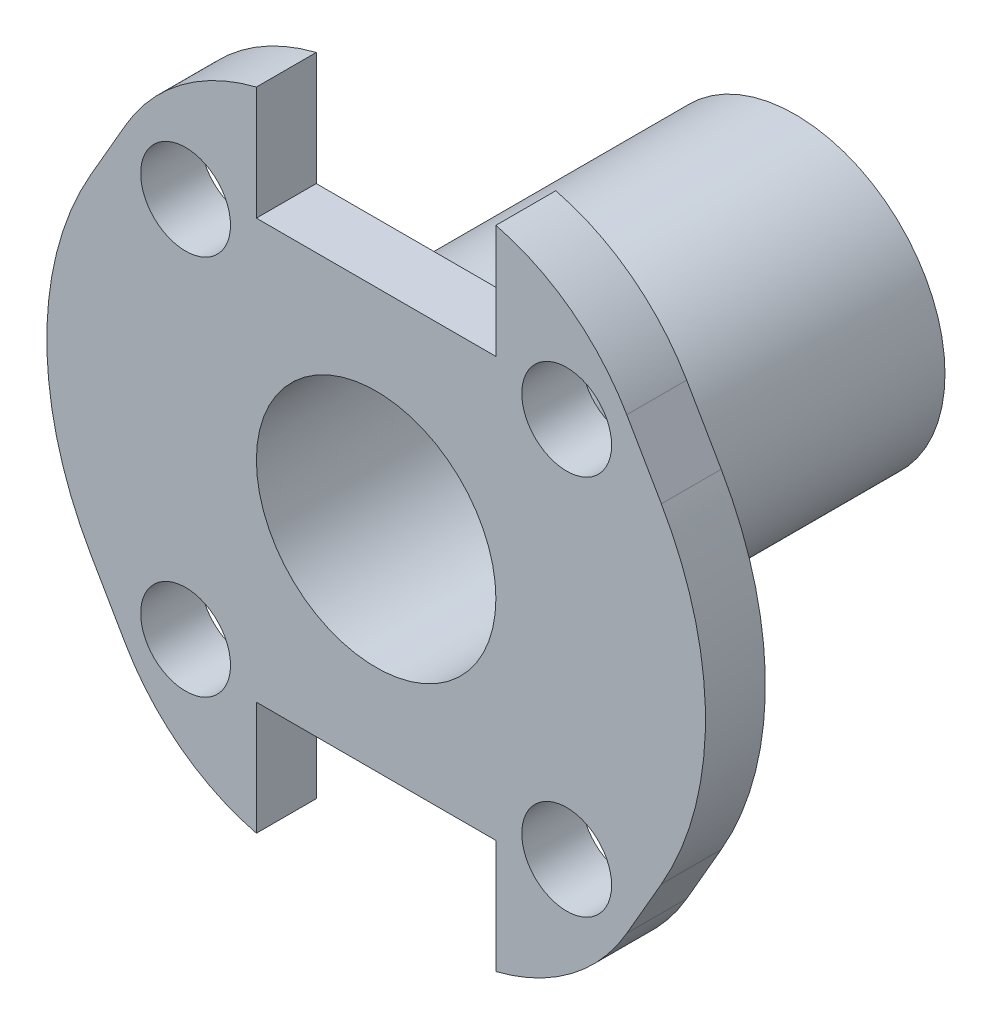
ISO-10303-21;
HEADER;
FILE_DESCRIPTION(('STEP AP214'),'2;1');
FILE_NAME('part.step','',(''),(''),'','','');
FILE_SCHEMA(('AUTOMOTIVE_DESIGN { 1 0 10303 214 1 1 1 1 }'));
ENDSEC;
DATA;
#1=APPLICATION_CONTEXT('core data for automotive mechanical design processes');
#2=APPLICATION_PROTOCOL_DEFINITION('international standard','automotive_design',2000,#1);
#3=PRODUCT_CONTEXT('',#1,'mechanical');
#4=PRODUCT('Part','Part','',(#3));
#5=PRODUCT_RELATED_PRODUCT_CATEGORY('part','',(#4));
#6=PRODUCT_DEFINITION_FORMATION('','',#4);
#7=PRODUCT_DEFINITION_CONTEXT('part definition',#1,'design');
#8=PRODUCT_DEFINITION('design','',#6,#7);
#9=PRODUCT_DEFINITION_SHAPE('','',#8);
#10=(LENGTH_UNIT() NAMED_UNIT(*) SI_UNIT(.MILLI.,.METRE.));
#11=(NAMED_UNIT(*) PLANE_ANGLE_UNIT() SI_UNIT($,.RADIAN.));
#12=(NAMED_UNIT(*) SI_UNIT($,.STERADIAN.) SOLID_ANGLE_UNIT());
#13=UNCERTAINTY_MEASURE_WITH_UNIT(LENGTH_MEASURE(1.E-05),#10,'distance_accuracy_value','');
#14=(GEOMETRIC_REPRESENTATION_CONTEXT(3) GLOBAL_UNCERTAINTY_ASSIGNED_CONTEXT((#13)) GLOBAL_UNIT_ASSIGNED_CONTEXT((#10,
#11,#12)) REPRESENTATION_CONTEXT('',''));
#15=CARTESIAN_POINT('',(0.,0.,0.));
#16=DIRECTION('',(0.,0.,1.));
#17=DIRECTION('',(1.,0.,0.));
#18=AXIS2_PLACEMENT_3D('',#15,#16,#17);
#19=CARTESIAN_POINT('',(-11.5470053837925,20.,10.));
#20=DIRECTION('',(0.,0.,1.));
#21=DIRECTION('',(1.,0.,0.));
#22=AXIS2_PLACEMENT_3D('',#19,#20,#21);
#23=PLANE('',#22);
#24=CARTESIAN_POINT('',(-31.819805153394,-31.8198051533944,10.));
#25=DIRECTION('',(0.,0.,1.));
#26=DIRECTION('',(1.,0.,0.));
#27=AXIS2_PLACEMENT_3D('',#24,#25,#26);
#28=CIRCLE('',#27,7.49999999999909);
#29=CARTESIAN_POINT('',(-24.3198051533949,-31.8198051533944,10.));
#30=VERTEX_POINT('',#29);
#31=EDGE_CURVE('E719',#30,#30,#28,.T.);
#32=ORIENTED_EDGE('',*,*,#31,.F.);
#33=EDGE_LOOP('',(#32));
#34=FACE_BOUND('',#33,.T.);
#35=CARTESIAN_POINT('',(31.8198051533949,31.8198051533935,10.));
#36=DIRECTION('',(0.,0.,1.));
#37=DIRECTION('',(1.,0.,0.));
#38=AXIS2_PLACEMENT_3D('',#35,#36,#37);
#39=CIRCLE('',#38,7.50000000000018);
#40=CARTESIAN_POINT('',(39.3198051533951,31.8198051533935,10.));
#41=VERTEX_POINT('',#40);
#42=EDGE_CURVE('E483',#41,#41,#39,.T.);
#43=ORIENTED_EDGE('',*,*,#42,.F.);
#44=EDGE_LOOP('',(#43));
#45=FACE_BOUND('',#44,.T.);
#46=DIRECTION('',(-1.,0.,0.));
#47=VECTOR('',#46,1.);
#48=CARTESIAN_POINT('',(20.,35.,10.));
#49=LINE('',#48,#47);
#50=CARTESIAN_POINT('',(20.,35.,10.));
#51=VERTEX_POINT('',#50);
#52=CARTESIAN_POINT('',(-20.,35.,10.));
#53=VERTEX_POINT('',#52);
#54=EDGE_CURVE('E517',#51,#53,#49,.T.);
#55=ORIENTED_EDGE('',*,*,#54,.T.);
#56=DIRECTION('',(0.,1.,0.));
#57=VECTOR('',#56,1.);
#58=CARTESIAN_POINT('',(-20.,35.,10.));
#59=LINE('',#58,#57);
#60=CARTESIAN_POINT('',(-20.,53.9639055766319,10.));
#61=VERTEX_POINT('',#60);
#62=EDGE_CURVE('E478',#53,#61,#59,.T.);
#63=ORIENTED_EDGE('',*,*,#62,.T.);
#64=CARTESIAN_POINT('',(-11.5470053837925,20.,10.));
#65=DIRECTION('',(0.,0.,1.));
#66=DIRECTION('',(1.,0.,0.));
#67=AXIS2_PLACEMENT_3D('',#64,#65,#66);
#68=CIRCLE('',#67,35.);
#69=CARTESIAN_POINT('',(-41.8578945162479,37.5,10.));
#70=VERTEX_POINT('',#69);
#71=EDGE_CURVE('E520',#61,#70,#68,.T.);
#72=ORIENTED_EDGE('',*,*,#71,.T.);
#73=DIRECTION('',(-0.5,-0.866025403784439,0.));
#74=VECTOR('',#73,1.);
#75=CARTESIAN_POINT('',(-41.8578945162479,37.5,10.));
#76=LINE('',#75,#74);
#77=CARTESIAN_POINT('',(-47.6313972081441,27.5,10.));
#78=VERTEX_POINT('',#77);
#79=EDGE_CURVE('E522',#70,#78,#76,.T.);
#80=ORIENTED_EDGE('',*,*,#79,.T.);
#81=CARTESIAN_POINT('',(0.,0.,10.));
#82=DIRECTION('',(0.,0.,1.));
#83=DIRECTION('',(1.,0.,0.));
#84=AXIS2_PLACEMENT_3D('',#81,#82,#83);
#85=CIRCLE('',#84,55.);
#86=CARTESIAN_POINT('',(-47.6313972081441,-27.5,10.));
#87=VERTEX_POINT('',#86);
#88=EDGE_CURVE('E524',#78,#87,#85,.T.);
#89=ORIENTED_EDGE('',*,*,#88,.T.);
#90=DIRECTION('',(0.500000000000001,-0.866025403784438,0.));
#91=VECTOR('',#90,1.);
#92=CARTESIAN_POINT('',(-47.6313972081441,-27.5,10.));
#93=LINE('',#92,#91);
#94=CARTESIAN_POINT('',(-41.8578945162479,-37.5,10.));
#95=VERTEX_POINT('',#94);
#96=EDGE_CURVE('E526',#87,#95,#93,.T.);
#97=ORIENTED_EDGE('',*,*,#96,.T.);
#98=CARTESIAN_POINT('',(-11.5470053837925,-20.,10.));
#99=DIRECTION('',(0.,0.,1.));
#100=DIRECTION('',(1.,0.,0.));
#101=AXIS2_PLACEMENT_3D('',#98,#99,#100);
#102=CIRCLE('',#101,35.);
#103=CARTESIAN_POINT('',(-20.,-53.9639055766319,10.));
#104=VERTEX_POINT('',#103);
#105=EDGE_CURVE('E528',#95,#104,#102,.T.);
#106=ORIENTED_EDGE('',*,*,#105,.T.);
#107=DIRECTION('',(0.,1.,0.));
#108=VECTOR('',#107,1.);
#109=CARTESIAN_POINT('',(-20.,-53.9639055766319,10.));
#110=LINE('',#109,#108);
#111=CARTESIAN_POINT('',(-20.,-35.,10.));
#112=VERTEX_POINT('',#111);
#113=EDGE_CURVE('E530',#104,#112,#110,.T.);
#114=ORIENTED_EDGE('',*,*,#113,.T.);
#115=DIRECTION('',(1.,0.,0.));
#116=VECTOR('',#115,1.);
#117=CARTESIAN_POINT('',(-20.,-35.,10.));
#118=LINE('',#117,#116);
#119=CARTESIAN_POINT('',(20.,-35.,10.));
#120=VERTEX_POINT('',#119);
#121=EDGE_CURVE('E532',#112,#120,#118,.T.);
#122=ORIENTED_EDGE('',*,*,#121,.T.);
#123=DIRECTION('',(0.,-1.,0.));
#124=VECTOR('',#123,1.);
#125=CARTESIAN_POINT('',(20.,-35.,10.));
#126=LINE('',#125,#124);
#127=CARTESIAN_POINT('',(20.,-53.9639055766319,10.));
#128=VERTEX_POINT('',#127);
#129=EDGE_CURVE('E534',#120,#128,#126,.T.);
#130=ORIENTED_EDGE('',*,*,#129,.T.);
#131=CARTESIAN_POINT('',(11.5470053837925,-20.,10.));
#132=DIRECTION('',(0.,0.,1.));
#133=DIRECTION('',(1.,0.,0.));
#134=AXIS2_PLACEMENT_3D('',#131,#132,#133);
#135=CIRCLE('',#134,35.);
#136=CARTESIAN_POINT('',(41.8578945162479,-37.5,10.));
#137=VERTEX_POINT('',#136);
#138=EDGE_CURVE('E536',#128,#137,#135,.T.);
#139=ORIENTED_EDGE('',*,*,#138,.T.);
#140=DIRECTION('',(0.5,0.866025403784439,0.));
#141=VECTOR('',#140,1.);
#142=CARTESIAN_POINT('',(41.8578945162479,-37.5,10.));
#143=LINE('',#142,#141);
#144=CARTESIAN_POINT('',(47.6313972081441,-27.5,10.));
#145=VERTEX_POINT('',#144);
#146=EDGE_CURVE('E538',#137,#145,#143,.T.);
#147=ORIENTED_EDGE('',*,*,#146,.T.);
#148=CARTESIAN_POINT('',(0.,0.,10.));
#149=DIRECTION('',(0.,0.,1.));
#150=DIRECTION('',(1.,0.,0.));
#151=AXIS2_PLACEMENT_3D('',#148,#149,#150);
#152=CIRCLE('',#151,55.);
#153=CARTESIAN_POINT('',(47.6313972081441,27.5,10.));
#154=VERTEX_POINT('',#153);
#155=EDGE_CURVE('E540',#145,#154,#152,.T.);
#156=ORIENTED_EDGE('',*,*,#155,.T.);
#157=DIRECTION('',(-0.499999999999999,0.866025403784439,0.));
#158=VECTOR('',#157,1.);
#159=CARTESIAN_POINT('',(47.6313972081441,27.5,10.));
#160=LINE('',#159,#158);
#161=CARTESIAN_POINT('',(41.8578945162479,37.5,10.));
#162=VERTEX_POINT('',#161);
#163=EDGE_CURVE('E542',#154,#162,#160,.T.);
#164=ORIENTED_EDGE('',*,*,#163,.T.);
#165=CARTESIAN_POINT('',(11.5470053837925,20.,10.));
#166=DIRECTION('',(0.,0.,1.));
#167=DIRECTION('',(1.,0.,0.));
#168=AXIS2_PLACEMENT_3D('',#165,#166,#167);
#169=CIRCLE('',#168,35.);
#170=CARTESIAN_POINT('',(20.,53.9639055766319,10.));
#171=VERTEX_POINT('',#170);
#172=EDGE_CURVE('E371',#162,#171,#169,.T.);
#173=ORIENTED_EDGE('',*,*,#172,.T.);
#174=DIRECTION('',(0.,-1.,0.));
#175=VECTOR('',#174,1.);
#176=CARTESIAN_POINT('',(20.,53.9639055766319,10.));
#177=LINE('',#176,#175);
#178=EDGE_CURVE('E366',#171,#51,#177,.T.);
#179=ORIENTED_EDGE('',*,*,#178,.T.);
#180=EDGE_LOOP('',(#55,#63,#72,#80,#89,#97,#106,#114,#122,#130,#139,#147,#156,#164,#173,#179));
#181=FACE_BOUND('',#180,.T.);
#182=CARTESIAN_POINT('',(31.8198051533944,-31.8198051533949,10.));
#183=DIRECTION('',(0.,0.,1.));
#184=DIRECTION('',(1.,0.,0.));
#185=AXIS2_PLACEMENT_3D('',#182,#183,#184);
#186=CIRCLE('',#185,7.5);
#187=CARTESIAN_POINT('',(39.3198051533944,-31.8198051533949,10.));
#188=VERTEX_POINT('',#187);
#189=EDGE_CURVE('E725',#188,#188,#186,.T.);
#190=ORIENTED_EDGE('',*,*,#189,.F.);
#191=EDGE_LOOP('',(#190));
#192=FACE_BOUND('',#191,.T.);
#193=CARTESIAN_POINT('',(-31.8198051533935,31.819805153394,10.));
#194=DIRECTION('',(0.,0.,1.));
#195=DIRECTION('',(1.,0.,0.));
#196=AXIS2_PLACEMENT_3D('',#193,#194,#195);
#197=CIRCLE('',#196,7.4999999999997);
#198=CARTESIAN_POINT('',(-24.3198051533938,31.819805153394,10.));
#199=VERTEX_POINT('',#198);
#200=EDGE_CURVE('E713',#199,#199,#197,.T.);
#201=ORIENTED_EDGE('',*,*,#200,.F.);
#202=EDGE_LOOP('',(#201));
#203=FACE_BOUND('',#202,.T.);
#204=CARTESIAN_POINT('',(0.,0.,10.));
#205=DIRECTION('',(0.,0.,1.));
#206=DIRECTION('',(1.,0.,0.));
#207=AXIS2_PLACEMENT_3D('',#204,#205,#206);
#208=CIRCLE('',#207,20.);
#209=CARTESIAN_POINT('',(20.,0.,10.));
#210=VERTEX_POINT('',#209);
#211=EDGE_CURVE('E705',#210,#210,#208,.T.);
#212=ORIENTED_EDGE('',*,*,#211,.F.);
#213=EDGE_LOOP('',(#212));
#214=FACE_BOUND('',#213,.T.);
#215=ADVANCED_FACE('F350',(#34,#45,#181,#192,#203,#214),#23,.T.);
#216=CARTESIAN_POINT('',(-11.5470053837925,20.,0.));
#217=DIRECTION('',(0.,0.,1.));
#218=DIRECTION('',(1.,0.,0.));
#219=AXIS2_PLACEMENT_3D('',#216,#217,#218);
#220=PLANE('',#219);
#221=CARTESIAN_POINT('',(0.,0.,0.));
#222=DIRECTION('',(0.,0.,1.));
#223=DIRECTION('',(1.,0.,0.));
#224=AXIS2_PLACEMENT_3D('',#221,#222,#223);
#225=CIRCLE('',#224,25.);
#226=CARTESIAN_POINT('',(25.,0.,0.));
#227=VERTEX_POINT('',#226);
#228=EDGE_CURVE('E354',#227,#227,#225,.T.);
#229=ORIENTED_EDGE('',*,*,#228,.T.);
#230=EDGE_LOOP('',(#229));
#231=FACE_BOUND('',#230,.T.);
#232=CARTESIAN_POINT('',(-31.819805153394,-31.8198051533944,0.));
#233=DIRECTION('',(0.,0.,1.));
#234=DIRECTION('',(1.,0.,0.));
#235=AXIS2_PLACEMENT_3D('',#232,#233,#234);
#236=CIRCLE('',#235,7.49999999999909);
#237=CARTESIAN_POINT('',(-24.3198051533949,-31.8198051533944,0.));
#238=VERTEX_POINT('',#237);
#239=EDGE_CURVE('E716',#238,#238,#236,.T.);
#240=ORIENTED_EDGE('',*,*,#239,.T.);
#241=EDGE_LOOP('',(#240));
#242=FACE_BOUND('',#241,.T.);
#243=CARTESIAN_POINT('',(31.8198051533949,31.8198051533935,0.));
#244=DIRECTION('',(0.,0.,1.));
#245=DIRECTION('',(1.,0.,0.));
#246=AXIS2_PLACEMENT_3D('',#243,#244,#245);
#247=CIRCLE('',#246,7.50000000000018);
#248=CARTESIAN_POINT('',(39.3198051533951,31.8198051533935,0.));
#249=VERTEX_POINT('',#248);
#250=EDGE_CURVE('E486',#249,#249,#247,.T.);
#251=ORIENTED_EDGE('',*,*,#250,.T.);
#252=EDGE_LOOP('',(#251));
#253=FACE_BOUND('',#252,.T.);
#254=DIRECTION('',(-1.,0.,0.));
#255=VECTOR('',#254,1.);
#256=CARTESIAN_POINT('',(20.,35.,0.));
#257=LINE('',#256,#255);
#258=CARTESIAN_POINT('',(20.,35.,0.));
#259=VERTEX_POINT('',#258);
#260=CARTESIAN_POINT('',(-20.,35.,0.));
#261=VERTEX_POINT('',#260);
#262=EDGE_CURVE('E469',#259,#261,#257,.T.);
#263=ORIENTED_EDGE('',*,*,#262,.F.);
#264=DIRECTION('',(0.,-1.,0.));
#265=VECTOR('',#264,1.);
#266=CARTESIAN_POINT('',(20.,53.9639055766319,0.));
#267=LINE('',#266,#265);
#268=CARTESIAN_POINT('',(20.,53.9639055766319,0.));
#269=VERTEX_POINT('',#268);
#270=EDGE_CURVE('E515',#269,#259,#267,.T.);
#271=ORIENTED_EDGE('',*,*,#270,.F.);
#272=CARTESIAN_POINT('',(11.5470053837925,20.,0.));
#273=DIRECTION('',(0.,0.,1.));
#274=DIRECTION('',(1.,0.,0.));
#275=AXIS2_PLACEMENT_3D('',#272,#273,#274);
#276=CIRCLE('',#275,35.);
#277=CARTESIAN_POINT('',(41.8578945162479,37.5,0.));
#278=VERTEX_POINT('',#277);
#279=EDGE_CURVE('E513',#278,#269,#276,.T.);
#280=ORIENTED_EDGE('',*,*,#279,.F.);
#281=DIRECTION('',(-0.499999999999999,0.866025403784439,0.));
#282=VECTOR('',#281,1.);
#283=CARTESIAN_POINT('',(47.6313972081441,27.5,0.));
#284=LINE('',#283,#282);
#285=CARTESIAN_POINT('',(47.6313972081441,27.5,0.));
#286=VERTEX_POINT('',#285);
#287=EDGE_CURVE('E511',#286,#278,#284,.T.);
#288=ORIENTED_EDGE('',*,*,#287,.F.);
#289=CARTESIAN_POINT('',(0.,0.,0.));
#290=DIRECTION('',(0.,0.,1.));
#291=DIRECTION('',(1.,0.,0.));
#292=AXIS2_PLACEMENT_3D('',#289,#290,#291);
#293=CIRCLE('',#292,55.);
#294=CARTESIAN_POINT('',(47.6313972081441,-27.5,0.));
#295=VERTEX_POINT('',#294);
#296=EDGE_CURVE('E509',#295,#286,#293,.T.);
#297=ORIENTED_EDGE('',*,*,#296,.F.);
#298=DIRECTION('',(0.5,0.866025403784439,0.));
#299=VECTOR('',#298,1.);
#300=CARTESIAN_POINT('',(41.8578945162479,-37.5,0.));
#301=LINE('',#300,#299);
#302=CARTESIAN_POINT('',(41.8578945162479,-37.5,0.));
#303=VERTEX_POINT('',#302);
#304=EDGE_CURVE('E507',#303,#295,#301,.T.);
#305=ORIENTED_EDGE('',*,*,#304,.F.);
#306=CARTESIAN_POINT('',(11.5470053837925,-20.,0.));
#307=DIRECTION('',(0.,0.,1.));
#308=DIRECTION('',(1.,0.,0.));
#309=AXIS2_PLACEMENT_3D('',#306,#307,#308);
#310=CIRCLE('',#309,35.);
#311=CARTESIAN_POINT('',(20.,-53.9639055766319,0.));
#312=VERTEX_POINT('',#311);
#313=EDGE_CURVE('E505',#312,#303,#310,.T.);
#314=ORIENTED_EDGE('',*,*,#313,.F.);
#315=DIRECTION('',(0.,-1.,0.));
#316=VECTOR('',#315,1.);
#317=CARTESIAN_POINT('',(20.,-35.,0.));
#318=LINE('',#317,#316);
#319=CARTESIAN_POINT('',(20.,-35.,0.));
#320=VERTEX_POINT('',#319);
#321=EDGE_CURVE('E503',#320,#312,#318,.T.);
#322=ORIENTED_EDGE('',*,*,#321,.F.);
#323=DIRECTION('',(1.,0.,0.));
#324=VECTOR('',#323,1.);
#325=CARTESIAN_POINT('',(-20.,-35.,0.));
#326=LINE('',#325,#324);
#327=CARTESIAN_POINT('',(-20.,-35.,0.));
#328=VERTEX_POINT('',#327);
#329=EDGE_CURVE('E501',#328,#320,#326,.T.);
#330=ORIENTED_EDGE('',*,*,#329,.F.);
#331=DIRECTION('',(0.,1.,0.));
#332=VECTOR('',#331,1.);
#333=CARTESIAN_POINT('',(-20.,-53.9639055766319,0.));
#334=LINE('',#333,#332);
#335=CARTESIAN_POINT('',(-20.,-53.9639055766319,0.));
#336=VERTEX_POINT('',#335);
#337=EDGE_CURVE('E499',#336,#328,#334,.T.);
#338=ORIENTED_EDGE('',*,*,#337,.F.);
#339=CARTESIAN_POINT('',(-11.5470053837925,-20.,0.));
#340=DIRECTION('',(0.,0.,1.));
#341=DIRECTION('',(1.,0.,0.));
#342=AXIS2_PLACEMENT_3D('',#339,#340,#341);
#343=CIRCLE('',#342,35.);
#344=CARTESIAN_POINT('',(-41.8578945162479,-37.5,0.));
#345=VERTEX_POINT('',#344);
#346=EDGE_CURVE('E497',#345,#336,#343,.T.);
#347=ORIENTED_EDGE('',*,*,#346,.F.);
#348=DIRECTION('',(0.500000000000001,-0.866025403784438,0.));
#349=VECTOR('',#348,1.);
#350=CARTESIAN_POINT('',(-47.6313972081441,-27.5,0.));
#351=LINE('',#350,#349);
#352=CARTESIAN_POINT('',(-47.6313972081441,-27.5,0.));
#353=VERTEX_POINT('',#352);
#354=EDGE_CURVE('E495',#353,#345,#351,.T.);
#355=ORIENTED_EDGE('',*,*,#354,.F.);
#356=CARTESIAN_POINT('',(0.,0.,0.));
#357=DIRECTION('',(0.,0.,1.));
#358=DIRECTION('',(1.,0.,0.));
#359=AXIS2_PLACEMENT_3D('',#356,#357,#358);
#360=CIRCLE('',#359,55.);
#361=CARTESIAN_POINT('',(-47.6313972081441,27.5,0.));
#362=VERTEX_POINT('',#361);
#363=EDGE_CURVE('E493',#362,#353,#360,.T.);
#364=ORIENTED_EDGE('',*,*,#363,.F.);
#365=DIRECTION('',(-0.5,-0.866025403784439,0.));
#366=VECTOR('',#365,1.);
#367=CARTESIAN_POINT('',(-41.8578945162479,37.5,0.));
#368=LINE('',#367,#366);
#369=CARTESIAN_POINT('',(-41.8578945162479,37.5,0.));
#370=VERTEX_POINT('',#369);
#371=EDGE_CURVE('E491',#370,#362,#368,.T.);
#372=ORIENTED_EDGE('',*,*,#371,.F.);
#373=CARTESIAN_POINT('',(-11.5470053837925,20.,0.));
#374=DIRECTION('',(0.,0.,1.));
#375=DIRECTION('',(1.,0.,0.));
#376=AXIS2_PLACEMENT_3D('',#373,#374,#375);
#377=CIRCLE('',#376,35.);
#378=CARTESIAN_POINT('',(-20.,53.9639055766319,0.));
#379=VERTEX_POINT('',#378);
#380=EDGE_CURVE('E471',#379,#370,#377,.T.);
#381=ORIENTED_EDGE('',*,*,#380,.F.);
#382=DIRECTION('',(0.,1.,0.));
#383=VECTOR('',#382,1.);
#384=CARTESIAN_POINT('',(-20.,35.,0.));
#385=LINE('',#384,#383);
#386=EDGE_CURVE('E464',#261,#379,#385,.T.);
#387=ORIENTED_EDGE('',*,*,#386,.F.);
#388=EDGE_LOOP('',(#263,#271,#280,#288,#297,#305,#314,#322,#330,#338,#347,#355,#364,#372,#381,#387));
#389=FACE_BOUND('',#388,.T.);
#390=CARTESIAN_POINT('',(31.8198051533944,-31.8198051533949,0.));
#391=DIRECTION('',(0.,0.,1.));
#392=DIRECTION('',(1.,0.,0.));
#393=AXIS2_PLACEMENT_3D('',#390,#391,#392);
#394=CIRCLE('',#393,7.5);
#395=CARTESIAN_POINT('',(39.3198051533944,-31.8198051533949,0.));
#396=VERTEX_POINT('',#395);
#397=EDGE_CURVE('E722',#396,#396,#394,.T.);
#398=ORIENTED_EDGE('',*,*,#397,.T.);
#399=EDGE_LOOP('',(#398));
#400=FACE_BOUND('',#399,.T.);
#401=CARTESIAN_POINT('',(-31.8198051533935,31.819805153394,0.));
#402=DIRECTION('',(0.,0.,1.));
#403=DIRECTION('',(1.,0.,0.));
#404=AXIS2_PLACEMENT_3D('',#401,#402,#403);
#405=CIRCLE('',#404,7.4999999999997);
#406=CARTESIAN_POINT('',(-24.3198051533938,31.819805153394,0.));
#407=VERTEX_POINT('',#406);
#408=EDGE_CURVE('E710',#407,#407,#405,.T.);
#409=ORIENTED_EDGE('',*,*,#408,.T.);
#410=EDGE_LOOP('',(#409));
#411=FACE_BOUND('',#410,.T.);
#412=ADVANCED_FACE('F465',(#231,#242,#253,#389,#400,#411),#220,.F.);
#413=CARTESIAN_POINT('',(20.,35.,10.));
#414=DIRECTION('',(0.,-1.,0.));
#415=DIRECTION('',(0.,0.,-1.));
#416=AXIS2_PLACEMENT_3D('',#413,#414,#415);
#417=PLANE('',#416);
#418=ORIENTED_EDGE('',*,*,#262,.T.);
#419=DIRECTION('',(0.,0.,-1.));
#420=VECTOR('',#419,1.);
#421=CARTESIAN_POINT('',(-20.,35.,10.));
#422=LINE('',#421,#420);
#423=EDGE_CURVE('E11',#53,#261,#422,.T.);
#424=ORIENTED_EDGE('',*,*,#423,.F.);
#425=ORIENTED_EDGE('',*,*,#54,.F.);
#426=DIRECTION('',(0.,0.,-1.));
#427=VECTOR('',#426,1.);
#428=CARTESIAN_POINT('',(20.,35.,10.));
#429=LINE('',#428,#427);
#430=EDGE_CURVE('E482',#51,#259,#429,.T.);
#431=ORIENTED_EDGE('',*,*,#430,.T.);
#432=EDGE_LOOP('',(#418,#424,#425,#431));
#433=FACE_BOUND('',#432,.T.);
#434=ADVANCED_FACE('F352',(#433),#417,.F.);
#435=CARTESIAN_POINT('',(-20.,35.,10.));
#436=DIRECTION('',(-1.,0.,0.));
#437=DIRECTION('',(0.,-1.,0.));
#438=AXIS2_PLACEMENT_3D('',#435,#436,#437);
#439=PLANE('',#438);
#440=ORIENTED_EDGE('',*,*,#386,.T.);
#441=DIRECTION('',(0.,0.,-1.));
#442=VECTOR('',#441,1.);
#443=CARTESIAN_POINT('',(-20.,53.9639055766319,10.));
#444=LINE('',#443,#442);
#445=EDGE_CURVE('E359',#61,#379,#444,.T.);
#446=ORIENTED_EDGE('',*,*,#445,.F.);
#447=ORIENTED_EDGE('',*,*,#62,.F.);
#448=ORIENTED_EDGE('',*,*,#423,.T.);
#449=EDGE_LOOP('',(#440,#446,#447,#448));
#450=FACE_BOUND('',#449,.T.);
#451=ADVANCED_FACE('F477',(#450),#439,.F.);
#452=CARTESIAN_POINT('',(-11.5470053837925,20.,10.));
#453=DIRECTION('',(0.,0.,-1.));
#454=DIRECTION('',(-1.,0.,0.));
#455=AXIS2_PLACEMENT_3D('',#452,#453,#454);
#456=CYLINDRICAL_SURFACE('',#455,35.);
#457=ORIENTED_EDGE('',*,*,#380,.T.);
#458=DIRECTION('',(0.,0.,-1.));
#459=VECTOR('',#458,1.);
#460=CARTESIAN_POINT('',(-41.8578945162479,37.5,10.));
#461=LINE('',#460,#459);
#462=EDGE_CURVE('E583',#70,#370,#461,.T.);
#463=ORIENTED_EDGE('',*,*,#462,.F.);
#464=ORIENTED_EDGE('',*,*,#71,.F.);
#465=ORIENTED_EDGE('',*,*,#445,.T.);
#466=EDGE_LOOP('',(#457,#463,#464,#465));
#467=FACE_BOUND('',#466,.T.);
#468=ADVANCED_FACE('F588',(#467),#456,.T.);
#469=CARTESIAN_POINT('',(-41.8578945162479,37.5,10.));
#470=DIRECTION('',(0.866025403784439,-0.5,0.));
#471=DIRECTION('',(0.5,0.866025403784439,0.));
#472=AXIS2_PLACEMENT_3D('',#469,#470,#471);
#473=PLANE('',#472);
#474=ORIENTED_EDGE('',*,*,#371,.T.);
#475=DIRECTION('',(0.,0.,-1.));
#476=VECTOR('',#475,1.);
#477=CARTESIAN_POINT('',(-47.6313972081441,27.5,10.));
#478=LINE('',#477,#476);
#479=EDGE_CURVE('E580',#78,#362,#478,.T.);
#480=ORIENTED_EDGE('',*,*,#479,.F.);
#481=ORIENTED_EDGE('',*,*,#79,.F.);
#482=ORIENTED_EDGE('',*,*,#462,.T.);
#483=EDGE_LOOP('',(#474,#480,#481,#482));
#484=FACE_BOUND('',#483,.T.);
#485=ADVANCED_FACE('F596',(#484),#473,.F.);
#486=CARTESIAN_POINT('',(0.,0.,10.));
#487=DIRECTION('',(0.,0.,-1.));
#488=DIRECTION('',(-1.,0.,0.));
#489=AXIS2_PLACEMENT_3D('',#486,#487,#488);
#490=CYLINDRICAL_SURFACE('',#489,55.);
#491=ORIENTED_EDGE('',*,*,#363,.T.);
#492=DIRECTION('',(0.,0.,-1.));
#493=VECTOR('',#492,1.);
#494=CARTESIAN_POINT('',(-47.6313972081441,-27.5,10.));
#495=LINE('',#494,#493);
#496=EDGE_CURVE('E577',#87,#353,#495,.T.);
#497=ORIENTED_EDGE('',*,*,#496,.F.);
#498=ORIENTED_EDGE('',*,*,#88,.F.);
#499=ORIENTED_EDGE('',*,*,#479,.T.);
#500=EDGE_LOOP('',(#491,#497,#498,#499));
#501=FACE_BOUND('',#500,.T.);
#502=ADVANCED_FACE('F599',(#501),#490,.T.);
#503=CARTESIAN_POINT('',(-47.6313972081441,-27.5,10.));
#504=DIRECTION('',(0.866025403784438,0.500000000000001,0.));
#505=DIRECTION('',(-0.500000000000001,0.866025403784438,0.));
#506=AXIS2_PLACEMENT_3D('',#503,#504,#505);
#507=PLANE('',#506);
#508=ORIENTED_EDGE('',*,*,#354,.T.);
#509=DIRECTION('',(0.,0.,-1.));
#510=VECTOR('',#509,1.);
#511=CARTESIAN_POINT('',(-41.8578945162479,-37.5,10.));
#512=LINE('',#511,#510);
#513=EDGE_CURVE('E574',#95,#345,#512,.T.);
#514=ORIENTED_EDGE('',*,*,#513,.F.);
#515=ORIENTED_EDGE('',*,*,#96,.F.);
#516=ORIENTED_EDGE('',*,*,#496,.T.);
#517=EDGE_LOOP('',(#508,#514,#515,#516));
#518=FACE_BOUND('',#517,.T.);
#519=ADVANCED_FACE('F604',(#518),#507,.F.);
#520=CARTESIAN_POINT('',(-11.5470053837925,-20.,10.));
#521=DIRECTION('',(0.,0.,-1.));
#522=DIRECTION('',(-1.,0.,0.));
#523=AXIS2_PLACEMENT_3D('',#520,#521,#522);
#524=CYLINDRICAL_SURFACE('',#523,35.);
#525=ORIENTED_EDGE('',*,*,#346,.T.);
#526=DIRECTION('',(0.,0.,-1.));
#527=VECTOR('',#526,1.);
#528=CARTESIAN_POINT('',(-20.,-53.9639055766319,10.));
#529=LINE('',#528,#527);
#530=EDGE_CURVE('E571',#104,#336,#529,.T.);
#531=ORIENTED_EDGE('',*,*,#530,.F.);
#532=ORIENTED_EDGE('',*,*,#105,.F.);
#533=ORIENTED_EDGE('',*,*,#513,.T.);
#534=EDGE_LOOP('',(#525,#531,#532,#533));
#535=FACE_BOUND('',#534,.T.);
#536=ADVANCED_FACE('F610',(#535),#524,.T.);
#537=CARTESIAN_POINT('',(-20.,-53.9639055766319,10.));
#538=DIRECTION('',(-1.,0.,0.));
#539=DIRECTION('',(0.,-1.,0.));
#540=AXIS2_PLACEMENT_3D('',#537,#538,#539);
#541=PLANE('',#540);
#542=ORIENTED_EDGE('',*,*,#337,.T.);
#543=DIRECTION('',(0.,0.,-1.));
#544=VECTOR('',#543,1.);
#545=CARTESIAN_POINT('',(-20.,-35.,10.));
#546=LINE('',#545,#544);
#547=EDGE_CURVE('E568',#112,#328,#546,.T.);
#548=ORIENTED_EDGE('',*,*,#547,.F.);
#549=ORIENTED_EDGE('',*,*,#113,.F.);
#550=ORIENTED_EDGE('',*,*,#530,.T.);
#551=EDGE_LOOP('',(#542,#548,#549,#550));
#552=FACE_BOUND('',#551,.T.);
#553=ADVANCED_FACE('F614',(#552),#541,.F.);
#554=CARTESIAN_POINT('',(-20.,-35.,10.));
#555=DIRECTION('',(0.,1.,0.));
#556=DIRECTION('',(0.,0.,1.));
#557=AXIS2_PLACEMENT_3D('',#554,#555,#556);
#558=PLANE('',#557);
#559=ORIENTED_EDGE('',*,*,#329,.T.);
#560=DIRECTION('',(0.,0.,-1.));
#561=VECTOR('',#560,1.);
#562=CARTESIAN_POINT('',(20.,-35.,10.));
#563=LINE('',#562,#561);
#564=EDGE_CURVE('E565',#120,#320,#563,.T.);
#565=ORIENTED_EDGE('',*,*,#564,.F.);
#566=ORIENTED_EDGE('',*,*,#121,.F.);
#567=ORIENTED_EDGE('',*,*,#547,.T.);
#568=EDGE_LOOP('',(#559,#565,#566,#567));
#569=FACE_BOUND('',#568,.T.);
#570=ADVANCED_FACE('F619',(#569),#558,.F.);
#571=CARTESIAN_POINT('',(20.,-35.,10.));
#572=DIRECTION('',(1.,0.,0.));
#573=DIRECTION('',(0.,1.,0.));
#574=AXIS2_PLACEMENT_3D('',#571,#572,#573);
#575=PLANE('',#574);
#576=ORIENTED_EDGE('',*,*,#321,.T.);
#577=DIRECTION('',(0.,0.,-1.));
#578=VECTOR('',#577,1.);
#579=CARTESIAN_POINT('',(20.,-53.9639055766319,10.));
#580=LINE('',#579,#578);
#581=EDGE_CURVE('E562',#128,#312,#580,.T.);
#582=ORIENTED_EDGE('',*,*,#581,.F.);
#583=ORIENTED_EDGE('',*,*,#129,.F.);
#584=ORIENTED_EDGE('',*,*,#564,.T.);
#585=EDGE_LOOP('',(#576,#582,#583,#584));
#586=FACE_BOUND('',#585,.T.);
#587=ADVANCED_FACE('F625',(#586),#575,.F.);
#588=CARTESIAN_POINT('',(11.5470053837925,-20.,10.));
#589=DIRECTION('',(0.,0.,-1.));
#590=DIRECTION('',(-1.,0.,0.));
#591=AXIS2_PLACEMENT_3D('',#588,#589,#590);
#592=CYLINDRICAL_SURFACE('',#591,35.);
#593=ORIENTED_EDGE('',*,*,#313,.T.);
#594=DIRECTION('',(0.,0.,-1.));
#595=VECTOR('',#594,1.);
#596=CARTESIAN_POINT('',(41.8578945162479,-37.5,10.));
#597=LINE('',#596,#595);
#598=EDGE_CURVE('E559',#137,#303,#597,.T.);
#599=ORIENTED_EDGE('',*,*,#598,.F.);
#600=ORIENTED_EDGE('',*,*,#138,.F.);
#601=ORIENTED_EDGE('',*,*,#581,.T.);
#602=EDGE_LOOP('',(#593,#599,#600,#601));
#603=FACE_BOUND('',#602,.T.);
#604=ADVANCED_FACE('F629',(#603),#592,.T.);
#605=CARTESIAN_POINT('',(41.8578945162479,-37.5,10.));
#606=DIRECTION('',(-0.866025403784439,0.5,0.));
#607=DIRECTION('',(-0.5,-0.866025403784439,0.));
#608=AXIS2_PLACEMENT_3D('',#605,#606,#607);
#609=PLANE('',#608);
#610=ORIENTED_EDGE('',*,*,#304,.T.);
#611=DIRECTION('',(0.,0.,-1.));
#612=VECTOR('',#611,1.);
#613=CARTESIAN_POINT('',(47.6313972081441,-27.5,10.));
#614=LINE('',#613,#612);
#615=EDGE_CURVE('E556',#145,#295,#614,.T.);
#616=ORIENTED_EDGE('',*,*,#615,.F.);
#617=ORIENTED_EDGE('',*,*,#146,.F.);
#618=ORIENTED_EDGE('',*,*,#598,.T.);
#619=EDGE_LOOP('',(#610,#616,#617,#618));
#620=FACE_BOUND('',#619,.T.);
#621=ADVANCED_FACE('F634',(#620),#609,.F.);
#622=CARTESIAN_POINT('',(0.,0.,10.));
#623=DIRECTION('',(0.,0.,-1.));
#624=DIRECTION('',(-1.,0.,0.));
#625=AXIS2_PLACEMENT_3D('',#622,#623,#624);
#626=CYLINDRICAL_SURFACE('',#625,55.);
#627=ORIENTED_EDGE('',*,*,#296,.T.);
#628=DIRECTION('',(0.,0.,-1.));
#629=VECTOR('',#628,1.);
#630=CARTESIAN_POINT('',(47.6313972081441,27.5,10.));
#631=LINE('',#630,#629);
#632=EDGE_CURVE('E553',#154,#286,#631,.T.);
#633=ORIENTED_EDGE('',*,*,#632,.F.);
#634=ORIENTED_EDGE('',*,*,#155,.F.);
#635=ORIENTED_EDGE('',*,*,#615,.T.);
#636=EDGE_LOOP('',(#627,#633,#634,#635));
#637=FACE_BOUND('',#636,.T.);
#638=ADVANCED_FACE('F640',(#637),#626,.T.);
#639=CARTESIAN_POINT('',(47.6313972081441,27.5,10.));
#640=DIRECTION('',(-0.866025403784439,-0.499999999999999,0.));
#641=DIRECTION('',(0.499999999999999,-0.866025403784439,0.));
#642=AXIS2_PLACEMENT_3D('',#639,#640,#641);
#643=PLANE('',#642);
#644=ORIENTED_EDGE('',*,*,#287,.T.);
#645=DIRECTION('',(0.,0.,-1.));
#646=VECTOR('',#645,1.);
#647=CARTESIAN_POINT('',(41.8578945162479,37.5,10.));
#648=LINE('',#647,#646);
#649=EDGE_CURVE('E550',#162,#278,#648,.T.);
#650=ORIENTED_EDGE('',*,*,#649,.F.);
#651=ORIENTED_EDGE('',*,*,#163,.F.);
#652=ORIENTED_EDGE('',*,*,#632,.T.);
#653=EDGE_LOOP('',(#644,#650,#651,#652));
#654=FACE_BOUND('',#653,.T.);
#655=ADVANCED_FACE('F644',(#654),#643,.F.);
#656=CARTESIAN_POINT('',(11.5470053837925,20.,10.));
#657=DIRECTION('',(0.,0.,-1.));
#658=DIRECTION('',(-1.,0.,0.));
#659=AXIS2_PLACEMENT_3D('',#656,#657,#658);
#660=CYLINDRICAL_SURFACE('',#659,35.);
#661=ORIENTED_EDGE('',*,*,#279,.T.);
#662=DIRECTION('',(0.,0.,-1.));
#663=VECTOR('',#662,1.);
#664=CARTESIAN_POINT('',(20.,53.9639055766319,10.));
#665=LINE('',#664,#663);
#666=EDGE_CURVE('E547',#171,#269,#665,.T.);
#667=ORIENTED_EDGE('',*,*,#666,.F.);
#668=ORIENTED_EDGE('',*,*,#172,.F.);
#669=ORIENTED_EDGE('',*,*,#649,.T.);
#670=EDGE_LOOP('',(#661,#667,#668,#669));
#671=FACE_BOUND('',#670,.T.);
#672=ADVANCED_FACE('F647',(#671),#660,.T.);
#673=CARTESIAN_POINT('',(20.,53.9639055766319,10.));
#674=DIRECTION('',(1.,0.,0.));
#675=DIRECTION('',(0.,1.,0.));
#676=AXIS2_PLACEMENT_3D('',#673,#674,#675);
#677=PLANE('',#676);
#678=ORIENTED_EDGE('',*,*,#270,.T.);
#679=ORIENTED_EDGE('',*,*,#430,.F.);
#680=ORIENTED_EDGE('',*,*,#178,.F.);
#681=ORIENTED_EDGE('',*,*,#666,.T.);
#682=EDGE_LOOP('',(#678,#679,#680,#681));
#683=FACE_BOUND('',#682,.T.);
#684=ADVANCED_FACE('F649',(#683),#677,.F.);
#685=CARTESIAN_POINT('',(31.8198051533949,31.8198051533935,10.));
#686=DIRECTION('',(0.,0.,-1.));
#687=DIRECTION('',(-1.,0.,0.));
#688=AXIS2_PLACEMENT_3D('',#685,#686,#687);
#689=CYLINDRICAL_SURFACE('',#688,7.50000000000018);
#690=ORIENTED_EDGE('',*,*,#42,.T.);
#691=EDGE_LOOP('',(#690));
#692=FACE_BOUND('',#691,.T.);
#693=ORIENTED_EDGE('',*,*,#250,.F.);
#694=EDGE_LOOP('',(#693));
#695=FACE_BOUND('',#694,.T.);
#696=ADVANCED_FACE('F651',(#692,#695),#689,.F.);
#697=CARTESIAN_POINT('',(31.8198051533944,-31.8198051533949,10.));
#698=DIRECTION('',(0.,0.,-1.));
#699=DIRECTION('',(-1.,0.,0.));
#700=AXIS2_PLACEMENT_3D('',#697,#698,#699);
#701=CYLINDRICAL_SURFACE('',#700,7.5);
#702=ORIENTED_EDGE('',*,*,#189,.T.);
#703=EDGE_LOOP('',(#702));
#704=FACE_BOUND('',#703,.T.);
#705=ORIENTED_EDGE('',*,*,#397,.F.);
#706=EDGE_LOOP('',(#705));
#707=FACE_BOUND('',#706,.T.);
#708=ADVANCED_FACE('F657',(#704,#707),#701,.F.);
#709=CARTESIAN_POINT('',(-31.819805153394,-31.8198051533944,10.));
#710=DIRECTION('',(0.,0.,-1.));
#711=DIRECTION('',(-1.,0.,0.));
#712=AXIS2_PLACEMENT_3D('',#709,#710,#711);
#713=CYLINDRICAL_SURFACE('',#712,7.49999999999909);
#714=ORIENTED_EDGE('',*,*,#31,.T.);
#715=EDGE_LOOP('',(#714));
#716=FACE_BOUND('',#715,.T.);
#717=ORIENTED_EDGE('',*,*,#239,.F.);
#718=EDGE_LOOP('',(#717));
#719=FACE_BOUND('',#718,.T.);
#720=ADVANCED_FACE('F675',(#716,#719),#713,.F.);
#721=CARTESIAN_POINT('',(-31.8198051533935,31.819805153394,10.));
#722=DIRECTION('',(0.,0.,-1.));
#723=DIRECTION('',(-1.,0.,0.));
#724=AXIS2_PLACEMENT_3D('',#721,#722,#723);
#725=CYLINDRICAL_SURFACE('',#724,7.4999999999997);
#726=ORIENTED_EDGE('',*,*,#200,.T.);
#727=EDGE_LOOP('',(#726));
#728=FACE_BOUND('',#727,.T.);
#729=ORIENTED_EDGE('',*,*,#408,.F.);
#730=EDGE_LOOP('',(#729));
#731=FACE_BOUND('',#730,.T.);
#732=ADVANCED_FACE('F679',(#728,#731),#725,.F.);
#733=CARTESIAN_POINT('',(0.,0.,0.));
#734=DIRECTION('',(0.,0.,1.));
#735=DIRECTION('',(1.,0.,0.));
#736=AXIS2_PLACEMENT_3D('',#733,#734,#735);
#737=CYLINDRICAL_SURFACE('',#736,20.);
#738=ORIENTED_EDGE('',*,*,#211,.T.);
#739=EDGE_LOOP('',(#738));
#740=FACE_BOUND('',#739,.T.);
#741=CARTESIAN_POINT('',(0.,0.,-60.));
#742=DIRECTION('',(0.,0.,1.));
#743=DIRECTION('',(1.,0.,0.));
#744=AXIS2_PLACEMENT_3D('',#741,#742,#743);
#745=CIRCLE('',#744,20.);
#746=CARTESIAN_POINT('',(20.,0.,-60.));
#747=VERTEX_POINT('',#746);
#748=EDGE_CURVE('E699',#747,#747,#745,.T.);
#749=ORIENTED_EDGE('',*,*,#748,.F.);
#750=EDGE_LOOP('',(#749));
#751=FACE_BOUND('',#750,.T.);
#752=ADVANCED_FACE('F682',(#740,#751),#737,.F.);
#753=CARTESIAN_POINT('',(0.,0.,-60.));
#754=DIRECTION('',(0.,0.,1.));
#755=DIRECTION('',(1.,0.,0.));
#756=AXIS2_PLACEMENT_3D('',#753,#754,#755);
#757=CYLINDRICAL_SURFACE('',#756,25.);
#758=CARTESIAN_POINT('',(0.,0.,-60.));
#759=DIRECTION('',(0.,0.,1.));
#760=DIRECTION('',(1.,0.,0.));
#761=AXIS2_PLACEMENT_3D('',#758,#759,#760);
#762=CIRCLE('',#761,25.);
#763=CARTESIAN_POINT('',(25.,0.,-60.));
#764=VERTEX_POINT('',#763);
#765=EDGE_CURVE('E702',#764,#764,#762,.T.);
#766=ORIENTED_EDGE('',*,*,#765,.T.);
#767=EDGE_LOOP('',(#766));
#768=FACE_BOUND('',#767,.T.);
#769=ORIENTED_EDGE('',*,*,#228,.F.);
#770=EDGE_LOOP('',(#769));
#771=FACE_BOUND('',#770,.T.);
#772=ADVANCED_FACE('F686',(#768,#771),#757,.T.);
#773=CARTESIAN_POINT('',(0.,0.,-60.));
#774=DIRECTION('',(0.,0.,1.));
#775=DIRECTION('',(1.,0.,0.));
#776=AXIS2_PLACEMENT_3D('',#773,#774,#775);
#777=PLANE('',#776);
#778=ORIENTED_EDGE('',*,*,#748,.T.);
#779=EDGE_LOOP('',(#778));
#780=FACE_BOUND('',#779,.T.);
#781=ORIENTED_EDGE('',*,*,#765,.F.);
#782=EDGE_LOOP('',(#781));
#783=FACE_BOUND('',#782,.T.);
#784=ADVANCED_FACE('F690',(#780,#783),#777,.F.);
#785=CLOSED_SHELL('',(#215,#412,#434,#451,#468,#485,#502,#519,#536,#553,#570,#587,#604,#621,
#638,#655,#672,#684,#696,#708,#720,#732,#752,#772,#784));
#786=MANIFOLD_SOLID_BREP('B2',#785);
#787=ADVANCED_BREP_SHAPE_REPRESENTATION('',(#18,#786),#14);
#788=SHAPE_DEFINITION_REPRESENTATION(#9,#787);
ENDSEC;
END-ISO-10303-21;
